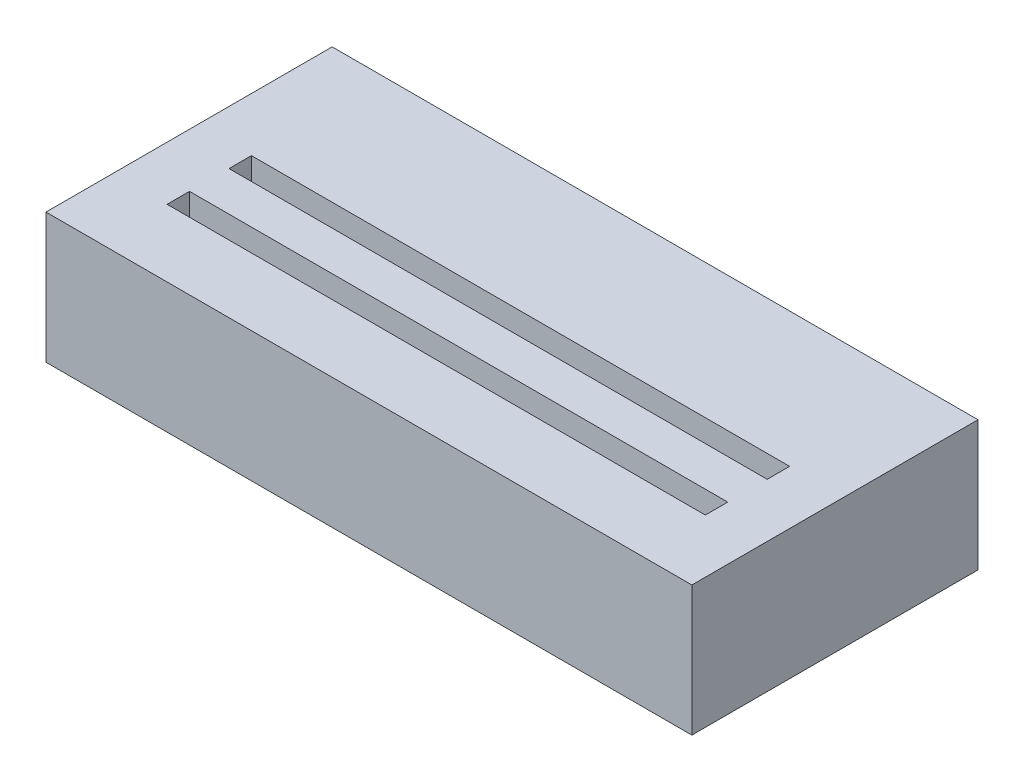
ISO-10303-21;
HEADER;
FILE_DESCRIPTION(('STEP AP214'),'2;1');
FILE_NAME('part.step','',(''),(''),'','','');
FILE_SCHEMA(('AUTOMOTIVE_DESIGN { 1 0 10303 214 1 1 1 1 }'));
ENDSEC;
DATA;
#1=APPLICATION_CONTEXT('core data for automotive mechanical design processes');
#2=APPLICATION_PROTOCOL_DEFINITION('international standard','automotive_design',2000,#1);
#3=PRODUCT_CONTEXT('',#1,'mechanical');
#4=PRODUCT('Part','Part','',(#3));
#5=PRODUCT_RELATED_PRODUCT_CATEGORY('part','',(#4));
#6=PRODUCT_DEFINITION_FORMATION('','',#4);
#7=PRODUCT_DEFINITION_CONTEXT('part definition',#1,'design');
#8=PRODUCT_DEFINITION('design','',#6,#7);
#9=PRODUCT_DEFINITION_SHAPE('','',#8);
#10=(LENGTH_UNIT() NAMED_UNIT(*) SI_UNIT(.MILLI.,.METRE.));
#11=(NAMED_UNIT(*) PLANE_ANGLE_UNIT() SI_UNIT($,.RADIAN.));
#12=(NAMED_UNIT(*) SI_UNIT($,.STERADIAN.) SOLID_ANGLE_UNIT());
#13=UNCERTAINTY_MEASURE_WITH_UNIT(LENGTH_MEASURE(1.E-05),#10,'distance_accuracy_value','');
#14=(GEOMETRIC_REPRESENTATION_CONTEXT(3) GLOBAL_UNCERTAINTY_ASSIGNED_CONTEXT((#13)) GLOBAL_UNIT_ASSIGNED_CONTEXT((#10,
#11,#12)) REPRESENTATION_CONTEXT('',''));
#15=CARTESIAN_POINT('',(0.,0.,0.));
#16=DIRECTION('',(0.,0.,1.));
#17=DIRECTION('',(1.,0.,0.));
#18=AXIS2_PLACEMENT_3D('',#15,#16,#17);
#19=CARTESIAN_POINT('',(-4.318,-2.413,7.62));
#20=DIRECTION('',(0.,1.,0.));
#21=DIRECTION('',(0.,0.,1.));
#22=AXIS2_PLACEMENT_3D('',#19,#20,#21);
#23=PLANE('',#22);
#24=DIRECTION('',(0.,0.,-1.));
#25=VECTOR('',#24,1.);
#26=CARTESIAN_POINT('',(-1.27,-2.413,12.3952));
#27=LINE('',#26,#25);
#28=CARTESIAN_POINT('',(-1.27,-2.413,12.3952));
#29=VERTEX_POINT('',#28);
#30=CARTESIAN_POINT('',(-1.27,-2.413,11.1252));
#31=VERTEX_POINT('',#30);
#32=EDGE_CURVE('E301',#29,#31,#27,.T.);
#33=ORIENTED_EDGE('',*,*,#32,.F.);
#34=DIRECTION('',(1.,0.,0.));
#35=VECTOR('',#34,1.);
#36=CARTESIAN_POINT('',(-4.318,-2.413,12.3952));
#37=LINE('',#36,#35);
#38=CARTESIAN_POINT('',(29.21,-2.413,12.3952));
#39=VERTEX_POINT('',#38);
#40=EDGE_CURVE('E169',#29,#39,#37,.T.);
#41=ORIENTED_EDGE('',*,*,#40,.T.);
#42=DIRECTION('',(0.,0.,-1.));
#43=VECTOR('',#42,1.);
#44=CARTESIAN_POINT('',(29.21,-2.413,12.3952));
#45=LINE('',#44,#43);
#46=CARTESIAN_POINT('',(29.21,-2.413,11.1252));
#47=VERTEX_POINT('',#46);
#48=EDGE_CURVE('E277',#39,#47,#45,.T.);
#49=ORIENTED_EDGE('',*,*,#48,.T.);
#50=DIRECTION('',(1.,0.,0.));
#51=VECTOR('',#50,1.);
#52=CARTESIAN_POINT('',(-4.318,-2.413,11.1252));
#53=LINE('',#52,#51);
#54=EDGE_CURVE('E299',#31,#47,#53,.T.);
#55=ORIENTED_EDGE('',*,*,#54,.F.);
#56=EDGE_LOOP('',(#33,#41,#49,#55));
#57=FACE_BOUND('',#56,.T.);
#58=DIRECTION('',(0.,0.,-1.));
#59=VECTOR('',#58,1.);
#60=CARTESIAN_POINT('',(11.557,-2.413,0.));
#61=LINE('',#60,#59);
#62=CARTESIAN_POINT('',(11.557,-2.413,7.62));
#63=VERTEX_POINT('',#62);
#64=CARTESIAN_POINT('',(11.557,-2.413,0.));
#65=VERTEX_POINT('',#64);
#66=EDGE_CURVE('E168',#63,#65,#61,.T.);
#67=ORIENTED_EDGE('',*,*,#66,.F.);
#68=DIRECTION('',(1.,0.,0.));
#69=VECTOR('',#68,1.);
#70=CARTESIAN_POINT('',(-4.318,-2.413,7.62));
#71=LINE('',#70,#69);
#72=CARTESIAN_POINT('',(-1.27,-2.413,7.62));
#73=VERTEX_POINT('',#72);
#74=EDGE_CURVE('E207',#73,#63,#71,.T.);
#75=ORIENTED_EDGE('',*,*,#74,.F.);
#76=DIRECTION('',(0.,0.,-1.));
#77=VECTOR('',#76,1.);
#78=CARTESIAN_POINT('',(-1.27,-2.413,8.89));
#79=LINE('',#78,#77);
#80=CARTESIAN_POINT('',(-1.27,-2.413,8.89));
#81=VERTEX_POINT('',#80);
#82=EDGE_CURVE('E338',#81,#73,#79,.T.);
#83=ORIENTED_EDGE('',*,*,#82,.F.);
#84=DIRECTION('',(1.,0.,0.));
#85=VECTOR('',#84,1.);
#86=CARTESIAN_POINT('',(-4.318,-2.413,8.89));
#87=LINE('',#86,#85);
#88=CARTESIAN_POINT('',(29.21,-2.413,8.89));
#89=VERTEX_POINT('',#88);
#90=EDGE_CURVE('E305',#81,#89,#87,.T.);
#91=ORIENTED_EDGE('',*,*,#90,.T.);
#92=DIRECTION('',(0.,0.,-1.));
#93=VECTOR('',#92,1.);
#94=CARTESIAN_POINT('',(29.21,-2.413,8.89));
#95=LINE('',#94,#93);
#96=CARTESIAN_POINT('',(29.21,-2.413,7.62));
#97=VERTEX_POINT('',#96);
#98=EDGE_CURVE('E321',#89,#97,#95,.T.);
#99=ORIENTED_EDGE('',*,*,#98,.T.);
#100=CARTESIAN_POINT('',(16.383,-2.413,7.62));
#101=VERTEX_POINT('',#100);
#102=EDGE_CURVE('E212',#101,#97,#71,.T.);
#103=ORIENTED_EDGE('',*,*,#102,.F.);
#104=DIRECTION('',(0.,0.,1.));
#105=VECTOR('',#104,1.);
#106=CARTESIAN_POINT('',(16.383,-2.413,0.));
#107=LINE('',#106,#105);
#108=CARTESIAN_POINT('',(16.383,-2.413,0.));
#109=VERTEX_POINT('',#108);
#110=EDGE_CURVE('E50',#109,#101,#107,.T.);
#111=ORIENTED_EDGE('',*,*,#110,.F.);
#112=DIRECTION('',(1.,0.,0.));
#113=VECTOR('',#112,1.);
#114=CARTESIAN_POINT('',(-4.318,-2.413,0.));
#115=LINE('',#114,#113);
#116=CARTESIAN_POINT('',(32.258,-2.413,0.));
#117=VERTEX_POINT('',#116);
#118=EDGE_CURVE('E194',#109,#117,#115,.T.);
#119=ORIENTED_EDGE('',*,*,#118,.T.);
#120=DIRECTION('',(0.,0.,-1.));
#121=VECTOR('',#120,1.);
#122=CARTESIAN_POINT('',(32.258,-2.413,7.62));
#123=LINE('',#122,#121);
#124=CARTESIAN_POINT('',(32.258,-2.413,16.2052));
#125=VERTEX_POINT('',#124);
#126=EDGE_CURVE('E42',#125,#117,#123,.T.);
#127=ORIENTED_EDGE('',*,*,#126,.F.);
#128=DIRECTION('',(1.,0.,0.));
#129=VECTOR('',#128,1.);
#130=CARTESIAN_POINT('',(-4.318,-2.413,16.2052));
#131=LINE('',#130,#129);
#132=CARTESIAN_POINT('',(-4.318,-2.413,16.2052));
#133=VERTEX_POINT('',#132);
#134=EDGE_CURVE('E266',#133,#125,#131,.T.);
#135=ORIENTED_EDGE('',*,*,#134,.F.);
#136=DIRECTION('',(0.,0.,-1.));
#137=VECTOR('',#136,1.);
#138=CARTESIAN_POINT('',(-4.318,-2.413,7.62));
#139=LINE('',#138,#137);
#140=CARTESIAN_POINT('',(-4.318,-2.413,0.));
#141=VERTEX_POINT('',#140);
#142=EDGE_CURVE('E11',#133,#141,#139,.T.);
#143=ORIENTED_EDGE('',*,*,#142,.T.);
#144=EDGE_CURVE('E56',#141,#65,#115,.T.);
#145=ORIENTED_EDGE('',*,*,#144,.T.);
#146=EDGE_LOOP('',(#67,#75,#83,#91,#99,#103,#111,#119,#127,#135,#143,#145));
#147=FACE_BOUND('',#146,.T.);
#148=ADVANCED_FACE('F33',(#57,#147),#23,.F.);
#149=CARTESIAN_POINT('',(-4.318,-2.413,11.1252));
#150=DIRECTION('',(0.,0.,1.));
#151=DIRECTION('',(1.,0.,0.));
#152=AXIS2_PLACEMENT_3D('',#149,#150,#151);
#153=PLANE('',#152);
#154=ORIENTED_EDGE('',*,*,#54,.T.);
#155=DIRECTION('',(0.,-1.,0.));
#156=VECTOR('',#155,1.);
#157=CARTESIAN_POINT('',(29.21,4.953,11.1252));
#158=LINE('',#157,#156);
#159=CARTESIAN_POINT('',(29.21,4.953,11.1252));
#160=VERTEX_POINT('',#159);
#161=EDGE_CURVE('E278',#160,#47,#158,.T.);
#162=ORIENTED_EDGE('',*,*,#161,.F.);
#163=DIRECTION('',(-1.,0.,0.));
#164=VECTOR('',#163,1.);
#165=CARTESIAN_POINT('',(-4.318,4.953,11.1252));
#166=LINE('',#165,#164);
#167=CARTESIAN_POINT('',(-1.27,4.953,11.1252));
#168=VERTEX_POINT('',#167);
#169=EDGE_CURVE('E232',#160,#168,#166,.T.);
#170=ORIENTED_EDGE('',*,*,#169,.T.);
#171=DIRECTION('',(0.,1.,0.));
#172=VECTOR('',#171,1.);
#173=CARTESIAN_POINT('',(-1.27,4.953,11.1252));
#174=LINE('',#173,#172);
#175=EDGE_CURVE('E287',#31,#168,#174,.T.);
#176=ORIENTED_EDGE('',*,*,#175,.F.);
#177=EDGE_LOOP('',(#154,#162,#170,#176));
#178=FACE_BOUND('',#177,.T.);
#179=ADVANCED_FACE('F480',(#178),#153,.T.);
#180=CARTESIAN_POINT('',(-4.318,-2.413,7.62));
#181=DIRECTION('',(0.,0.,1.));
#182=DIRECTION('',(1.,0.,0.));
#183=AXIS2_PLACEMENT_3D('',#180,#181,#182);
#184=PLANE('',#183);
#185=CARTESIAN_POINT('',(0.,0.,7.62));
#186=DIRECTION('',(0.,0.,1.));
#187=DIRECTION('',(1.,0.,0.));
#188=AXIS2_PLACEMENT_3D('',#185,#186,#187);
#189=CIRCLE('',#188,0.508);
#190=CARTESIAN_POINT('',(0.508,0.,7.62));
#191=VERTEX_POINT('',#190);
#192=EDGE_CURVE('E226',#191,#191,#189,.F.);
#193=ORIENTED_EDGE('',*,*,#192,.T.);
#194=EDGE_LOOP('',(#193));
#195=FACE_BOUND('',#194,.T.);
#196=CARTESIAN_POINT('',(2.54,0.,7.62));
#197=DIRECTION('',(0.,0.,1.));
#198=DIRECTION('',(1.,0.,0.));
#199=AXIS2_PLACEMENT_3D('',#196,#197,#198);
#200=CIRCLE('',#199,0.508);
#201=CARTESIAN_POINT('',(3.048,0.,7.62));
#202=VERTEX_POINT('',#201);
#203=EDGE_CURVE('E470',#202,#202,#200,.F.);
#204=ORIENTED_EDGE('',*,*,#203,.T.);
#205=EDGE_LOOP('',(#204));
#206=FACE_BOUND('',#205,.T.);
#207=CARTESIAN_POINT('',(5.08,0.,7.62));
#208=DIRECTION('',(0.,0.,1.));
#209=DIRECTION('',(1.,0.,0.));
#210=AXIS2_PLACEMENT_3D('',#207,#208,#209);
#211=CIRCLE('',#210,0.508);
#212=CARTESIAN_POINT('',(5.588,0.,7.62));
#213=VERTEX_POINT('',#212);
#214=EDGE_CURVE('E464',#213,#213,#211,.F.);
#215=ORIENTED_EDGE('',*,*,#214,.T.);
#216=EDGE_LOOP('',(#215));
#217=FACE_BOUND('',#216,.T.);
#218=CARTESIAN_POINT('',(7.62,0.,7.62));
#219=DIRECTION('',(0.,0.,1.));
#220=DIRECTION('',(1.,0.,0.));
#221=AXIS2_PLACEMENT_3D('',#218,#219,#220);
#222=CIRCLE('',#221,0.508);
#223=CARTESIAN_POINT('',(8.128,0.,7.62));
#224=VERTEX_POINT('',#223);
#225=EDGE_CURVE('E458',#224,#224,#222,.F.);
#226=ORIENTED_EDGE('',*,*,#225,.T.);
#227=EDGE_LOOP('',(#226));
#228=FACE_BOUND('',#227,.T.);
#229=CARTESIAN_POINT('',(10.16,0.,7.62));
#230=DIRECTION('',(0.,0.,1.));
#231=DIRECTION('',(1.,0.,0.));
#232=AXIS2_PLACEMENT_3D('',#229,#230,#231);
#233=CIRCLE('',#232,0.508);
#234=CARTESIAN_POINT('',(10.668,0.,7.62));
#235=VERTEX_POINT('',#234);
#236=EDGE_CURVE('E452',#235,#235,#233,.F.);
#237=ORIENTED_EDGE('',*,*,#236,.T.);
#238=EDGE_LOOP('',(#237));
#239=FACE_BOUND('',#238,.T.);
#240=CARTESIAN_POINT('',(12.7,0.,7.62));
#241=DIRECTION('',(0.,0.,1.));
#242=DIRECTION('',(1.,0.,0.));
#243=AXIS2_PLACEMENT_3D('',#240,#241,#242);
#244=CIRCLE('',#243,0.508);
#245=CARTESIAN_POINT('',(13.208,0.,7.62));
#246=VERTEX_POINT('',#245);
#247=EDGE_CURVE('E446',#246,#246,#244,.F.);
#248=ORIENTED_EDGE('',*,*,#247,.T.);
#249=EDGE_LOOP('',(#248));
#250=FACE_BOUND('',#249,.T.);
#251=CARTESIAN_POINT('',(15.24,0.,7.62));
#252=DIRECTION('',(0.,0.,1.));
#253=DIRECTION('',(1.,0.,0.));
#254=AXIS2_PLACEMENT_3D('',#251,#252,#253);
#255=CIRCLE('',#254,0.508);
#256=CARTESIAN_POINT('',(15.748,0.,7.62));
#257=VERTEX_POINT('',#256);
#258=EDGE_CURVE('E440',#257,#257,#255,.F.);
#259=ORIENTED_EDGE('',*,*,#258,.T.);
#260=EDGE_LOOP('',(#259));
#261=FACE_BOUND('',#260,.T.);
#262=CARTESIAN_POINT('',(17.78,0.,7.62));
#263=DIRECTION('',(0.,0.,1.));
#264=DIRECTION('',(1.,0.,0.));
#265=AXIS2_PLACEMENT_3D('',#262,#263,#264);
#266=CIRCLE('',#265,0.508000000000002);
#267=CARTESIAN_POINT('',(18.288,0.,7.62));
#268=VERTEX_POINT('',#267);
#269=EDGE_CURVE('E434',#268,#268,#266,.F.);
#270=ORIENTED_EDGE('',*,*,#269,.T.);
#271=EDGE_LOOP('',(#270));
#272=FACE_BOUND('',#271,.T.);
#273=CARTESIAN_POINT('',(20.32,0.,7.62));
#274=DIRECTION('',(0.,0.,1.));
#275=DIRECTION('',(1.,0.,0.));
#276=AXIS2_PLACEMENT_3D('',#273,#274,#275);
#277=CIRCLE('',#276,0.508000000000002);
#278=CARTESIAN_POINT('',(20.828,0.,7.62));
#279=VERTEX_POINT('',#278);
#280=EDGE_CURVE('E428',#279,#279,#277,.F.);
#281=ORIENTED_EDGE('',*,*,#280,.T.);
#282=EDGE_LOOP('',(#281));
#283=FACE_BOUND('',#282,.T.);
#284=CARTESIAN_POINT('',(22.86,0.,7.62));
#285=DIRECTION('',(0.,0.,1.));
#286=DIRECTION('',(1.,0.,0.));
#287=AXIS2_PLACEMENT_3D('',#284,#285,#286);
#288=CIRCLE('',#287,0.508000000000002);
#289=CARTESIAN_POINT('',(23.368,0.,7.62));
#290=VERTEX_POINT('',#289);
#291=EDGE_CURVE('E422',#290,#290,#288,.F.);
#292=ORIENTED_EDGE('',*,*,#291,.T.);
#293=EDGE_LOOP('',(#292));
#294=FACE_BOUND('',#293,.T.);
#295=CARTESIAN_POINT('',(25.4,0.,7.62));
#296=DIRECTION('',(0.,0.,1.));
#297=DIRECTION('',(1.,0.,0.));
#298=AXIS2_PLACEMENT_3D('',#295,#296,#297);
#299=CIRCLE('',#298,0.508000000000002);
#300=CARTESIAN_POINT('',(25.908,0.,7.62));
#301=VERTEX_POINT('',#300);
#302=EDGE_CURVE('E416',#301,#301,#299,.F.);
#303=ORIENTED_EDGE('',*,*,#302,.T.);
#304=EDGE_LOOP('',(#303));
#305=FACE_BOUND('',#304,.T.);
#306=CARTESIAN_POINT('',(27.94,0.,7.62));
#307=DIRECTION('',(0.,0.,1.));
#308=DIRECTION('',(1.,0.,0.));
#309=AXIS2_PLACEMENT_3D('',#306,#307,#308);
#310=CIRCLE('',#309,0.508000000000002);
#311=CARTESIAN_POINT('',(28.448,0.,7.62));
#312=VERTEX_POINT('',#311);
#313=EDGE_CURVE('E410',#312,#312,#310,.F.);
#314=ORIENTED_EDGE('',*,*,#313,.T.);
#315=EDGE_LOOP('',(#314));
#316=FACE_BOUND('',#315,.T.);
#317=CARTESIAN_POINT('',(0.,2.54,7.62));
#318=DIRECTION('',(0.,0.,1.));
#319=DIRECTION('',(1.,0.,0.));
#320=AXIS2_PLACEMENT_3D('',#317,#318,#319);
#321=CIRCLE('',#320,0.508);
#322=CARTESIAN_POINT('',(0.508,2.54,7.62));
#323=VERTEX_POINT('',#322);
#324=EDGE_CURVE('E404',#323,#323,#321,.F.);
#325=ORIENTED_EDGE('',*,*,#324,.T.);
#326=EDGE_LOOP('',(#325));
#327=FACE_BOUND('',#326,.T.);
#328=CARTESIAN_POINT('',(2.54,2.54,7.62));
#329=DIRECTION('',(0.,0.,1.));
#330=DIRECTION('',(1.,0.,0.));
#331=AXIS2_PLACEMENT_3D('',#328,#329,#330);
#332=CIRCLE('',#331,0.508);
#333=CARTESIAN_POINT('',(3.048,2.54,7.62));
#334=VERTEX_POINT('',#333);
#335=EDGE_CURVE('E398',#334,#334,#332,.F.);
#336=ORIENTED_EDGE('',*,*,#335,.T.);
#337=EDGE_LOOP('',(#336));
#338=FACE_BOUND('',#337,.T.);
#339=CARTESIAN_POINT('',(5.08,2.54,7.62));
#340=DIRECTION('',(0.,0.,1.));
#341=DIRECTION('',(1.,0.,0.));
#342=AXIS2_PLACEMENT_3D('',#339,#340,#341);
#343=CIRCLE('',#342,0.508);
#344=CARTESIAN_POINT('',(5.588,2.54,7.62));
#345=VERTEX_POINT('',#344);
#346=EDGE_CURVE('E392',#345,#345,#343,.F.);
#347=ORIENTED_EDGE('',*,*,#346,.T.);
#348=EDGE_LOOP('',(#347));
#349=FACE_BOUND('',#348,.T.);
#350=CARTESIAN_POINT('',(7.62,2.54,7.62));
#351=DIRECTION('',(0.,0.,1.));
#352=DIRECTION('',(1.,0.,0.));
#353=AXIS2_PLACEMENT_3D('',#350,#351,#352);
#354=CIRCLE('',#353,0.508);
#355=CARTESIAN_POINT('',(8.128,2.54,7.62));
#356=VERTEX_POINT('',#355);
#357=EDGE_CURVE('E386',#356,#356,#354,.F.);
#358=ORIENTED_EDGE('',*,*,#357,.T.);
#359=EDGE_LOOP('',(#358));
#360=FACE_BOUND('',#359,.T.);
#361=CARTESIAN_POINT('',(10.16,2.54,7.62));
#362=DIRECTION('',(0.,0.,1.));
#363=DIRECTION('',(1.,0.,0.));
#364=AXIS2_PLACEMENT_3D('',#361,#362,#363);
#365=CIRCLE('',#364,0.508);
#366=CARTESIAN_POINT('',(10.668,2.54,7.62));
#367=VERTEX_POINT('',#366);
#368=EDGE_CURVE('E380',#367,#367,#365,.F.);
#369=ORIENTED_EDGE('',*,*,#368,.T.);
#370=EDGE_LOOP('',(#369));
#371=FACE_BOUND('',#370,.T.);
#372=CARTESIAN_POINT('',(12.7,2.54,7.62));
#373=DIRECTION('',(0.,0.,1.));
#374=DIRECTION('',(1.,0.,0.));
#375=AXIS2_PLACEMENT_3D('',#372,#373,#374);
#376=CIRCLE('',#375,0.508);
#377=CARTESIAN_POINT('',(13.208,2.54,7.62));
#378=VERTEX_POINT('',#377);
#379=EDGE_CURVE('E374',#378,#378,#376,.F.);
#380=ORIENTED_EDGE('',*,*,#379,.T.);
#381=EDGE_LOOP('',(#380));
#382=FACE_BOUND('',#381,.T.);
#383=CARTESIAN_POINT('',(15.24,2.54,7.62));
#384=DIRECTION('',(0.,0.,1.));
#385=DIRECTION('',(1.,0.,0.));
#386=AXIS2_PLACEMENT_3D('',#383,#384,#385);
#387=CIRCLE('',#386,0.508);
#388=CARTESIAN_POINT('',(15.748,2.54,7.62));
#389=VERTEX_POINT('',#388);
#390=EDGE_CURVE('E368',#389,#389,#387,.F.);
#391=ORIENTED_EDGE('',*,*,#390,.T.);
#392=EDGE_LOOP('',(#391));
#393=FACE_BOUND('',#392,.T.);
#394=CARTESIAN_POINT('',(17.78,2.54,7.62));
#395=DIRECTION('',(0.,0.,1.));
#396=DIRECTION('',(1.,0.,0.));
#397=AXIS2_PLACEMENT_3D('',#394,#395,#396);
#398=CIRCLE('',#397,0.508000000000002);
#399=CARTESIAN_POINT('',(18.288,2.54,7.62));
#400=VERTEX_POINT('',#399);
#401=EDGE_CURVE('E362',#400,#400,#398,.F.);
#402=ORIENTED_EDGE('',*,*,#401,.T.);
#403=EDGE_LOOP('',(#402));
#404=FACE_BOUND('',#403,.T.);
#405=CARTESIAN_POINT('',(20.32,2.54,7.62));
#406=DIRECTION('',(0.,0.,1.));
#407=DIRECTION('',(1.,0.,0.));
#408=AXIS2_PLACEMENT_3D('',#405,#406,#407);
#409=CIRCLE('',#408,0.508000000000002);
#410=CARTESIAN_POINT('',(20.828,2.54,7.62));
#411=VERTEX_POINT('',#410);
#412=EDGE_CURVE('E356',#411,#411,#409,.F.);
#413=ORIENTED_EDGE('',*,*,#412,.T.);
#414=EDGE_LOOP('',(#413));
#415=FACE_BOUND('',#414,.T.);
#416=CARTESIAN_POINT('',(22.86,2.54,7.62));
#417=DIRECTION('',(0.,0.,1.));
#418=DIRECTION('',(1.,0.,0.));
#419=AXIS2_PLACEMENT_3D('',#416,#417,#418);
#420=CIRCLE('',#419,0.508000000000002);
#421=CARTESIAN_POINT('',(23.368,2.54,7.62));
#422=VERTEX_POINT('',#421);
#423=EDGE_CURVE('E350',#422,#422,#420,.F.);
#424=ORIENTED_EDGE('',*,*,#423,.T.);
#425=EDGE_LOOP('',(#424));
#426=FACE_BOUND('',#425,.T.);
#427=CARTESIAN_POINT('',(25.4,2.54,7.62));
#428=DIRECTION('',(0.,0.,1.));
#429=DIRECTION('',(1.,0.,0.));
#430=AXIS2_PLACEMENT_3D('',#427,#428,#429);
#431=CIRCLE('',#430,0.508000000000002);
#432=CARTESIAN_POINT('',(25.908,2.54,7.62));
#433=VERTEX_POINT('',#432);
#434=EDGE_CURVE('E344',#433,#433,#431,.F.);
#435=ORIENTED_EDGE('',*,*,#434,.T.);
#436=EDGE_LOOP('',(#435));
#437=FACE_BOUND('',#436,.T.);
#438=CARTESIAN_POINT('',(27.94,2.54,7.62));
#439=DIRECTION('',(0.,0.,1.));
#440=DIRECTION('',(1.,0.,0.));
#441=AXIS2_PLACEMENT_3D('',#438,#439,#440);
#442=CIRCLE('',#441,0.508000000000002);
#443=CARTESIAN_POINT('',(28.448,2.54,7.62));
#444=VERTEX_POINT('',#443);
#445=EDGE_CURVE('E337',#444,#444,#442,.F.);
#446=ORIENTED_EDGE('',*,*,#445,.T.);
#447=EDGE_LOOP('',(#446));
#448=FACE_BOUND('',#447,.T.);
#449=ORIENTED_EDGE('',*,*,#74,.T.);
#450=DIRECTION('',(0.,1.,0.));
#451=VECTOR('',#450,1.);
#452=CARTESIAN_POINT('',(11.557,-3.048,7.62));
#453=LINE('',#452,#451);
#454=CARTESIAN_POINT('',(11.557,-3.048,7.62));
#455=VERTEX_POINT('',#454);
#456=EDGE_CURVE('E182',#455,#63,#453,.T.);
#457=ORIENTED_EDGE('',*,*,#456,.F.);
#458=DIRECTION('',(-1.,0.,0.));
#459=VECTOR('',#458,1.);
#460=CARTESIAN_POINT('',(11.557,-3.048,7.62));
#461=LINE('',#460,#459);
#462=CARTESIAN_POINT('',(16.383,-3.048,7.62));
#463=VERTEX_POINT('',#462);
#464=EDGE_CURVE('E162',#463,#455,#461,.T.);
#465=ORIENTED_EDGE('',*,*,#464,.F.);
#466=DIRECTION('',(0.,1.,0.));
#467=VECTOR('',#466,1.);
#468=CARTESIAN_POINT('',(16.383,-3.048,7.62));
#469=LINE('',#468,#467);
#470=EDGE_CURVE('E174',#463,#101,#469,.T.);
#471=ORIENTED_EDGE('',*,*,#470,.T.);
#472=ORIENTED_EDGE('',*,*,#102,.T.);
#473=DIRECTION('',(0.,-1.,0.));
#474=VECTOR('',#473,1.);
#475=CARTESIAN_POINT('',(29.21,4.953,7.62));
#476=LINE('',#475,#474);
#477=CARTESIAN_POINT('',(29.21,4.953,7.62));
#478=VERTEX_POINT('',#477);
#479=EDGE_CURVE('E322',#478,#97,#476,.T.);
#480=ORIENTED_EDGE('',*,*,#479,.F.);
#481=DIRECTION('',(-1.,0.,0.));
#482=VECTOR('',#481,1.);
#483=CARTESIAN_POINT('',(-4.318,4.953,7.62));
#484=LINE('',#483,#482);
#485=CARTESIAN_POINT('',(-1.27,4.953,7.62));
#486=VERTEX_POINT('',#485);
#487=EDGE_CURVE('E211',#478,#486,#484,.T.);
#488=ORIENTED_EDGE('',*,*,#487,.T.);
#489=DIRECTION('',(0.,1.,0.));
#490=VECTOR('',#489,1.);
#491=CARTESIAN_POINT('',(-1.27,4.953,7.62));
#492=LINE('',#491,#490);
#493=EDGE_CURVE('E209',#73,#486,#492,.T.);
#494=ORIENTED_EDGE('',*,*,#493,.F.);
#495=EDGE_LOOP('',(#449,#457,#465,#471,#472,#480,#488,#494));
#496=FACE_BOUND('',#495,.T.);
#497=ADVANCED_FACE('F205',(#195,#206,#217,#228,#239,#250,#261,#272,#283,#294,#305,#316,#327,
#338,#349,#360,#371,#382,#393,#404,#415,#426,#437,#448,#496),#184,.T.);
#498=CARTESIAN_POINT('',(-4.318,4.953,7.62));
#499=DIRECTION('',(1.,0.,0.));
#500=DIRECTION('',(0.,1.,0.));
#501=AXIS2_PLACEMENT_3D('',#498,#499,#500);
#502=PLANE('',#501);
#503=DIRECTION('',(0.,-1.,0.));
#504=VECTOR('',#503,1.);
#505=CARTESIAN_POINT('',(-4.318,4.953,0.));
#506=LINE('',#505,#504);
#507=CARTESIAN_POINT('',(-4.318,4.953,0.));
#508=VERTEX_POINT('',#507);
#509=EDGE_CURVE('E238',#508,#141,#506,.T.);
#510=ORIENTED_EDGE('',*,*,#509,.T.);
#511=ORIENTED_EDGE('',*,*,#142,.F.);
#512=DIRECTION('',(0.,-1.,0.));
#513=VECTOR('',#512,1.);
#514=CARTESIAN_POINT('',(-4.318,4.953,16.2052));
#515=LINE('',#514,#513);
#516=CARTESIAN_POINT('',(-4.318,4.953,16.2052));
#517=VERTEX_POINT('',#516);
#518=EDGE_CURVE('E189',#517,#133,#515,.T.);
#519=ORIENTED_EDGE('',*,*,#518,.F.);
#520=DIRECTION('',(0.,0.,-1.));
#521=VECTOR('',#520,1.);
#522=CARTESIAN_POINT('',(-4.318,4.953,7.62));
#523=LINE('',#522,#521);
#524=EDGE_CURVE('E214',#517,#508,#523,.T.);
#525=ORIENTED_EDGE('',*,*,#524,.T.);
#526=EDGE_LOOP('',(#510,#511,#519,#525));
#527=FACE_BOUND('',#526,.T.);
#528=ADVANCED_FACE('F35',(#527),#502,.F.);
#529=CARTESIAN_POINT('',(32.258,4.953,7.62));
#530=DIRECTION('',(-1.,0.,0.));
#531=DIRECTION('',(0.,0.,1.));
#532=AXIS2_PLACEMENT_3D('',#529,#530,#531);
#533=PLANE('',#532);
#534=DIRECTION('',(0.,1.,0.));
#535=VECTOR('',#534,1.);
#536=CARTESIAN_POINT('',(32.258,4.953,0.));
#537=LINE('',#536,#535);
#538=CARTESIAN_POINT('',(32.258,4.953,0.));
#539=VERTEX_POINT('',#538);
#540=EDGE_CURVE('E235',#117,#539,#537,.T.);
#541=ORIENTED_EDGE('',*,*,#540,.T.);
#542=DIRECTION('',(0.,0.,-1.));
#543=VECTOR('',#542,1.);
#544=CARTESIAN_POINT('',(32.258,4.953,7.62));
#545=LINE('',#544,#543);
#546=CARTESIAN_POINT('',(32.258,4.953,16.2052));
#547=VERTEX_POINT('',#546);
#548=EDGE_CURVE('E244',#547,#539,#545,.T.);
#549=ORIENTED_EDGE('',*,*,#548,.F.);
#550=DIRECTION('',(0.,1.,0.));
#551=VECTOR('',#550,1.);
#552=CARTESIAN_POINT('',(32.258,4.953,16.2052));
#553=LINE('',#552,#551);
#554=EDGE_CURVE('E252',#125,#547,#553,.T.);
#555=ORIENTED_EDGE('',*,*,#554,.F.);
#556=ORIENTED_EDGE('',*,*,#126,.T.);
#557=EDGE_LOOP('',(#541,#549,#555,#556));
#558=FACE_BOUND('',#557,.T.);
#559=ADVANCED_FACE('F250',(#558),#533,.F.);
#560=CARTESIAN_POINT('',(-4.318,4.953,7.62));
#561=DIRECTION('',(0.,-1.,0.));
#562=DIRECTION('',(0.,0.,-1.));
#563=AXIS2_PLACEMENT_3D('',#560,#561,#562);
#564=PLANE('',#563);
#565=ORIENTED_EDGE('',*,*,#524,.F.);
#566=DIRECTION('',(-1.,0.,0.));
#567=VECTOR('',#566,1.);
#568=CARTESIAN_POINT('',(-4.318,4.953,16.2052));
#569=LINE('',#568,#567);
#570=EDGE_CURVE('E281',#547,#517,#569,.T.);
#571=ORIENTED_EDGE('',*,*,#570,.F.);
#572=ORIENTED_EDGE('',*,*,#548,.T.);
#573=DIRECTION('',(-1.,0.,0.));
#574=VECTOR('',#573,1.);
#575=CARTESIAN_POINT('',(-4.318,4.953,0.));
#576=LINE('',#575,#574);
#577=EDGE_CURVE('E216',#539,#508,#576,.T.);
#578=ORIENTED_EDGE('',*,*,#577,.T.);
#579=EDGE_LOOP('',(#565,#571,#572,#578));
#580=FACE_BOUND('',#579,.T.);
#581=DIRECTION('',(-1.,0.,0.));
#582=VECTOR('',#581,1.);
#583=CARTESIAN_POINT('',(-4.318,4.953,12.3952));
#584=LINE('',#583,#582);
#585=CARTESIAN_POINT('',(29.21,4.953,12.3952));
#586=VERTEX_POINT('',#585);
#587=CARTESIAN_POINT('',(-1.27,4.953,12.3952));
#588=VERTEX_POINT('',#587);
#589=EDGE_CURVE('E172',#586,#588,#584,.T.);
#590=ORIENTED_EDGE('',*,*,#589,.T.);
#591=DIRECTION('',(0.,0.,-1.));
#592=VECTOR('',#591,1.);
#593=CARTESIAN_POINT('',(-1.27,4.953,12.3952));
#594=LINE('',#593,#592);
#595=EDGE_CURVE('E291',#588,#168,#594,.T.);
#596=ORIENTED_EDGE('',*,*,#595,.T.);
#597=ORIENTED_EDGE('',*,*,#169,.F.);
#598=DIRECTION('',(0.,0.,-1.));
#599=VECTOR('',#598,1.);
#600=CARTESIAN_POINT('',(29.21,4.953,12.3952));
#601=LINE('',#600,#599);
#602=EDGE_CURVE('E284',#586,#160,#601,.T.);
#603=ORIENTED_EDGE('',*,*,#602,.F.);
#604=EDGE_LOOP('',(#590,#596,#597,#603));
#605=FACE_BOUND('',#604,.T.);
#606=DIRECTION('',(-1.,0.,0.));
#607=VECTOR('',#606,1.);
#608=CARTESIAN_POINT('',(-4.318,4.953,8.89));
#609=LINE('',#608,#607);
#610=CARTESIAN_POINT('',(29.21,4.953,8.89));
#611=VERTEX_POINT('',#610);
#612=CARTESIAN_POINT('',(-1.27,4.953,8.89));
#613=VERTEX_POINT('',#612);
#614=EDGE_CURVE('E310',#611,#613,#609,.T.);
#615=ORIENTED_EDGE('',*,*,#614,.T.);
#616=DIRECTION('',(0.,0.,-1.));
#617=VECTOR('',#616,1.);
#618=CARTESIAN_POINT('',(-1.27,4.953,8.89));
#619=LINE('',#618,#617);
#620=EDGE_CURVE('E331',#613,#486,#619,.T.);
#621=ORIENTED_EDGE('',*,*,#620,.T.);
#622=ORIENTED_EDGE('',*,*,#487,.F.);
#623=DIRECTION('',(0.,0.,-1.));
#624=VECTOR('',#623,1.);
#625=CARTESIAN_POINT('',(29.21,4.953,8.89));
#626=LINE('',#625,#624);
#627=EDGE_CURVE('E326',#611,#478,#626,.T.);
#628=ORIENTED_EDGE('',*,*,#627,.F.);
#629=EDGE_LOOP('',(#615,#621,#622,#628));
#630=FACE_BOUND('',#629,.T.);
#631=ADVANCED_FACE('F258',(#580,#605,#630),#564,.F.);
#632=CARTESIAN_POINT('',(-4.318,-2.413,0.));
#633=DIRECTION('',(0.,0.,1.));
#634=DIRECTION('',(1.,0.,0.));
#635=AXIS2_PLACEMENT_3D('',#632,#633,#634);
#636=PLANE('',#635);
#637=CARTESIAN_POINT('',(27.94,2.54,0.));
#638=DIRECTION('',(0.,0.,-1.));
#639=DIRECTION('',(-1.,0.,0.));
#640=AXIS2_PLACEMENT_3D('',#637,#638,#639);
#641=CIRCLE('',#640,0.508000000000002);
#642=CARTESIAN_POINT('',(27.432,2.54,0.));
#643=VERTEX_POINT('',#642);
#644=EDGE_CURVE('E334',#643,#643,#641,.T.);
#645=ORIENTED_EDGE('',*,*,#644,.F.);
#646=EDGE_LOOP('',(#645));
#647=FACE_BOUND('',#646,.T.);
#648=CARTESIAN_POINT('',(25.4,2.54,0.));
#649=DIRECTION('',(0.,0.,-1.));
#650=DIRECTION('',(-1.,0.,0.));
#651=AXIS2_PLACEMENT_3D('',#648,#649,#650);
#652=CIRCLE('',#651,0.508000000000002);
#653=CARTESIAN_POINT('',(24.892,2.54,0.));
#654=VERTEX_POINT('',#653);
#655=EDGE_CURVE('E341',#654,#654,#652,.T.);
#656=ORIENTED_EDGE('',*,*,#655,.F.);
#657=EDGE_LOOP('',(#656));
#658=FACE_BOUND('',#657,.T.);
#659=CARTESIAN_POINT('',(22.86,2.54,0.));
#660=DIRECTION('',(0.,0.,-1.));
#661=DIRECTION('',(-1.,0.,0.));
#662=AXIS2_PLACEMENT_3D('',#659,#660,#661);
#663=CIRCLE('',#662,0.508000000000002);
#664=CARTESIAN_POINT('',(22.352,2.54,0.));
#665=VERTEX_POINT('',#664);
#666=EDGE_CURVE('E347',#665,#665,#663,.T.);
#667=ORIENTED_EDGE('',*,*,#666,.F.);
#668=EDGE_LOOP('',(#667));
#669=FACE_BOUND('',#668,.T.);
#670=CARTESIAN_POINT('',(20.32,2.54,0.));
#671=DIRECTION('',(0.,0.,-1.));
#672=DIRECTION('',(-1.,0.,0.));
#673=AXIS2_PLACEMENT_3D('',#670,#671,#672);
#674=CIRCLE('',#673,0.508000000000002);
#675=CARTESIAN_POINT('',(19.812,2.54,0.));
#676=VERTEX_POINT('',#675);
#677=EDGE_CURVE('E353',#676,#676,#674,.T.);
#678=ORIENTED_EDGE('',*,*,#677,.F.);
#679=EDGE_LOOP('',(#678));
#680=FACE_BOUND('',#679,.T.);
#681=CARTESIAN_POINT('',(17.78,2.54,0.));
#682=DIRECTION('',(0.,0.,-1.));
#683=DIRECTION('',(-1.,0.,0.));
#684=AXIS2_PLACEMENT_3D('',#681,#682,#683);
#685=CIRCLE('',#684,0.508000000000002);
#686=CARTESIAN_POINT('',(17.272,2.54,0.));
#687=VERTEX_POINT('',#686);
#688=EDGE_CURVE('E359',#687,#687,#685,.T.);
#689=ORIENTED_EDGE('',*,*,#688,.F.);
#690=EDGE_LOOP('',(#689));
#691=FACE_BOUND('',#690,.T.);
#692=CARTESIAN_POINT('',(15.24,2.54,0.));
#693=DIRECTION('',(0.,0.,-1.));
#694=DIRECTION('',(-1.,0.,0.));
#695=AXIS2_PLACEMENT_3D('',#692,#693,#694);
#696=CIRCLE('',#695,0.508);
#697=CARTESIAN_POINT('',(14.732,2.54,0.));
#698=VERTEX_POINT('',#697);
#699=EDGE_CURVE('E365',#698,#698,#696,.T.);
#700=ORIENTED_EDGE('',*,*,#699,.F.);
#701=EDGE_LOOP('',(#700));
#702=FACE_BOUND('',#701,.T.);
#703=CARTESIAN_POINT('',(12.7,2.54,0.));
#704=DIRECTION('',(0.,0.,-1.));
#705=DIRECTION('',(-1.,0.,0.));
#706=AXIS2_PLACEMENT_3D('',#703,#704,#705);
#707=CIRCLE('',#706,0.508);
#708=CARTESIAN_POINT('',(12.192,2.54,0.));
#709=VERTEX_POINT('',#708);
#710=EDGE_CURVE('E371',#709,#709,#707,.T.);
#711=ORIENTED_EDGE('',*,*,#710,.F.);
#712=EDGE_LOOP('',(#711));
#713=FACE_BOUND('',#712,.T.);
#714=CARTESIAN_POINT('',(10.16,2.54,0.));
#715=DIRECTION('',(0.,0.,-1.));
#716=DIRECTION('',(-1.,0.,0.));
#717=AXIS2_PLACEMENT_3D('',#714,#715,#716);
#718=CIRCLE('',#717,0.508);
#719=CARTESIAN_POINT('',(9.652,2.54,0.));
#720=VERTEX_POINT('',#719);
#721=EDGE_CURVE('E377',#720,#720,#718,.T.);
#722=ORIENTED_EDGE('',*,*,#721,.F.);
#723=EDGE_LOOP('',(#722));
#724=FACE_BOUND('',#723,.T.);
#725=CARTESIAN_POINT('',(7.62,2.54,0.));
#726=DIRECTION('',(0.,0.,-1.));
#727=DIRECTION('',(-1.,0.,0.));
#728=AXIS2_PLACEMENT_3D('',#725,#726,#727);
#729=CIRCLE('',#728,0.508);
#730=CARTESIAN_POINT('',(7.112,2.54,0.));
#731=VERTEX_POINT('',#730);
#732=EDGE_CURVE('E383',#731,#731,#729,.T.);
#733=ORIENTED_EDGE('',*,*,#732,.F.);
#734=EDGE_LOOP('',(#733));
#735=FACE_BOUND('',#734,.T.);
#736=CARTESIAN_POINT('',(5.08,2.54,0.));
#737=DIRECTION('',(0.,0.,-1.));
#738=DIRECTION('',(-1.,0.,0.));
#739=AXIS2_PLACEMENT_3D('',#736,#737,#738);
#740=CIRCLE('',#739,0.508);
#741=CARTESIAN_POINT('',(4.572,2.54,0.));
#742=VERTEX_POINT('',#741);
#743=EDGE_CURVE('E389',#742,#742,#740,.T.);
#744=ORIENTED_EDGE('',*,*,#743,.F.);
#745=EDGE_LOOP('',(#744));
#746=FACE_BOUND('',#745,.T.);
#747=CARTESIAN_POINT('',(2.54,2.54,0.));
#748=DIRECTION('',(0.,0.,-1.));
#749=DIRECTION('',(-1.,0.,0.));
#750=AXIS2_PLACEMENT_3D('',#747,#748,#749);
#751=CIRCLE('',#750,0.508);
#752=CARTESIAN_POINT('',(2.032,2.54,0.));
#753=VERTEX_POINT('',#752);
#754=EDGE_CURVE('E395',#753,#753,#751,.T.);
#755=ORIENTED_EDGE('',*,*,#754,.F.);
#756=EDGE_LOOP('',(#755));
#757=FACE_BOUND('',#756,.T.);
#758=CARTESIAN_POINT('',(0.,2.54,0.));
#759=DIRECTION('',(0.,0.,-1.));
#760=DIRECTION('',(-1.,0.,0.));
#761=AXIS2_PLACEMENT_3D('',#758,#759,#760);
#762=CIRCLE('',#761,0.508);
#763=CARTESIAN_POINT('',(-0.508,2.54,0.));
#764=VERTEX_POINT('',#763);
#765=EDGE_CURVE('E401',#764,#764,#762,.T.);
#766=ORIENTED_EDGE('',*,*,#765,.F.);
#767=EDGE_LOOP('',(#766));
#768=FACE_BOUND('',#767,.T.);
#769=CARTESIAN_POINT('',(27.94,0.,0.));
#770=DIRECTION('',(0.,0.,-1.));
#771=DIRECTION('',(-1.,0.,0.));
#772=AXIS2_PLACEMENT_3D('',#769,#770,#771);
#773=CIRCLE('',#772,0.508000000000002);
#774=CARTESIAN_POINT('',(27.432,0.,0.));
#775=VERTEX_POINT('',#774);
#776=EDGE_CURVE('E407',#775,#775,#773,.T.);
#777=ORIENTED_EDGE('',*,*,#776,.F.);
#778=EDGE_LOOP('',(#777));
#779=FACE_BOUND('',#778,.T.);
#780=CARTESIAN_POINT('',(25.4,0.,0.));
#781=DIRECTION('',(0.,0.,-1.));
#782=DIRECTION('',(-1.,0.,0.));
#783=AXIS2_PLACEMENT_3D('',#780,#781,#782);
#784=CIRCLE('',#783,0.508000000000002);
#785=CARTESIAN_POINT('',(24.892,0.,0.));
#786=VERTEX_POINT('',#785);
#787=EDGE_CURVE('E413',#786,#786,#784,.T.);
#788=ORIENTED_EDGE('',*,*,#787,.F.);
#789=EDGE_LOOP('',(#788));
#790=FACE_BOUND('',#789,.T.);
#791=CARTESIAN_POINT('',(22.86,0.,0.));
#792=DIRECTION('',(0.,0.,-1.));
#793=DIRECTION('',(-1.,0.,0.));
#794=AXIS2_PLACEMENT_3D('',#791,#792,#793);
#795=CIRCLE('',#794,0.508000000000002);
#796=CARTESIAN_POINT('',(22.352,0.,0.));
#797=VERTEX_POINT('',#796);
#798=EDGE_CURVE('E419',#797,#797,#795,.T.);
#799=ORIENTED_EDGE('',*,*,#798,.F.);
#800=EDGE_LOOP('',(#799));
#801=FACE_BOUND('',#800,.T.);
#802=CARTESIAN_POINT('',(20.32,0.,0.));
#803=DIRECTION('',(0.,0.,-1.));
#804=DIRECTION('',(-1.,0.,0.));
#805=AXIS2_PLACEMENT_3D('',#802,#803,#804);
#806=CIRCLE('',#805,0.508000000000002);
#807=CARTESIAN_POINT('',(19.812,0.,0.));
#808=VERTEX_POINT('',#807);
#809=EDGE_CURVE('E425',#808,#808,#806,.T.);
#810=ORIENTED_EDGE('',*,*,#809,.F.);
#811=EDGE_LOOP('',(#810));
#812=FACE_BOUND('',#811,.T.);
#813=CARTESIAN_POINT('',(17.78,0.,0.));
#814=DIRECTION('',(0.,0.,-1.));
#815=DIRECTION('',(-1.,0.,0.));
#816=AXIS2_PLACEMENT_3D('',#813,#814,#815);
#817=CIRCLE('',#816,0.508000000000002);
#818=CARTESIAN_POINT('',(17.272,0.,0.));
#819=VERTEX_POINT('',#818);
#820=EDGE_CURVE('E431',#819,#819,#817,.T.);
#821=ORIENTED_EDGE('',*,*,#820,.F.);
#822=EDGE_LOOP('',(#821));
#823=FACE_BOUND('',#822,.T.);
#824=CARTESIAN_POINT('',(15.24,0.,0.));
#825=DIRECTION('',(0.,0.,-1.));
#826=DIRECTION('',(-1.,0.,0.));
#827=AXIS2_PLACEMENT_3D('',#824,#825,#826);
#828=CIRCLE('',#827,0.508);
#829=CARTESIAN_POINT('',(14.732,0.,0.));
#830=VERTEX_POINT('',#829);
#831=EDGE_CURVE('E437',#830,#830,#828,.T.);
#832=ORIENTED_EDGE('',*,*,#831,.F.);
#833=EDGE_LOOP('',(#832));
#834=FACE_BOUND('',#833,.T.);
#835=CARTESIAN_POINT('',(12.7,0.,0.));
#836=DIRECTION('',(0.,0.,-1.));
#837=DIRECTION('',(-1.,0.,0.));
#838=AXIS2_PLACEMENT_3D('',#835,#836,#837);
#839=CIRCLE('',#838,0.508);
#840=CARTESIAN_POINT('',(12.192,0.,0.));
#841=VERTEX_POINT('',#840);
#842=EDGE_CURVE('E443',#841,#841,#839,.T.);
#843=ORIENTED_EDGE('',*,*,#842,.F.);
#844=EDGE_LOOP('',(#843));
#845=FACE_BOUND('',#844,.T.);
#846=CARTESIAN_POINT('',(10.16,0.,0.));
#847=DIRECTION('',(0.,0.,-1.));
#848=DIRECTION('',(-1.,0.,0.));
#849=AXIS2_PLACEMENT_3D('',#846,#847,#848);
#850=CIRCLE('',#849,0.508);
#851=CARTESIAN_POINT('',(9.652,0.,0.));
#852=VERTEX_POINT('',#851);
#853=EDGE_CURVE('E449',#852,#852,#850,.T.);
#854=ORIENTED_EDGE('',*,*,#853,.F.);
#855=EDGE_LOOP('',(#854));
#856=FACE_BOUND('',#855,.T.);
#857=CARTESIAN_POINT('',(7.62,0.,0.));
#858=DIRECTION('',(0.,0.,-1.));
#859=DIRECTION('',(-1.,0.,0.));
#860=AXIS2_PLACEMENT_3D('',#857,#858,#859);
#861=CIRCLE('',#860,0.508);
#862=CARTESIAN_POINT('',(7.112,0.,0.));
#863=VERTEX_POINT('',#862);
#864=EDGE_CURVE('E455',#863,#863,#861,.T.);
#865=ORIENTED_EDGE('',*,*,#864,.F.);
#866=EDGE_LOOP('',(#865));
#867=FACE_BOUND('',#866,.T.);
#868=CARTESIAN_POINT('',(5.08,0.,0.));
#869=DIRECTION('',(0.,0.,-1.));
#870=DIRECTION('',(-1.,0.,0.));
#871=AXIS2_PLACEMENT_3D('',#868,#869,#870);
#872=CIRCLE('',#871,0.508);
#873=CARTESIAN_POINT('',(4.572,0.,0.));
#874=VERTEX_POINT('',#873);
#875=EDGE_CURVE('E461',#874,#874,#872,.T.);
#876=ORIENTED_EDGE('',*,*,#875,.F.);
#877=EDGE_LOOP('',(#876));
#878=FACE_BOUND('',#877,.T.);
#879=CARTESIAN_POINT('',(2.54,0.,0.));
#880=DIRECTION('',(0.,0.,-1.));
#881=DIRECTION('',(-1.,0.,0.));
#882=AXIS2_PLACEMENT_3D('',#879,#880,#881);
#883=CIRCLE('',#882,0.508);
#884=CARTESIAN_POINT('',(2.032,0.,0.));
#885=VERTEX_POINT('',#884);
#886=EDGE_CURVE('E467',#885,#885,#883,.T.);
#887=ORIENTED_EDGE('',*,*,#886,.F.);
#888=EDGE_LOOP('',(#887));
#889=FACE_BOUND('',#888,.T.);
#890=CARTESIAN_POINT('',(0.,0.,0.));
#891=DIRECTION('',(0.,0.,-1.));
#892=DIRECTION('',(-1.,0.,0.));
#893=AXIS2_PLACEMENT_3D('',#890,#891,#892);
#894=CIRCLE('',#893,0.508);
#895=CARTESIAN_POINT('',(-0.508,0.,0.));
#896=VERTEX_POINT('',#895);
#897=EDGE_CURVE('E472',#896,#896,#894,.T.);
#898=ORIENTED_EDGE('',*,*,#897,.F.);
#899=EDGE_LOOP('',(#898));
#900=FACE_BOUND('',#899,.T.);
#901=ORIENTED_EDGE('',*,*,#509,.F.);
#902=ORIENTED_EDGE('',*,*,#577,.F.);
#903=ORIENTED_EDGE('',*,*,#540,.F.);
#904=ORIENTED_EDGE('',*,*,#118,.F.);
#905=DIRECTION('',(0.,1.,0.));
#906=VECTOR('',#905,1.);
#907=CARTESIAN_POINT('',(16.383,-3.048,0.));
#908=LINE('',#907,#906);
#909=CARTESIAN_POINT('',(16.383,-3.048,0.));
#910=VERTEX_POINT('',#909);
#911=EDGE_CURVE('E153',#910,#109,#908,.T.);
#912=ORIENTED_EDGE('',*,*,#911,.F.);
#913=DIRECTION('',(1.,0.,0.));
#914=VECTOR('',#913,1.);
#915=CARTESIAN_POINT('',(11.557,-3.048,0.));
#916=LINE('',#915,#914);
#917=CARTESIAN_POINT('',(11.557,-3.048,0.));
#918=VERTEX_POINT('',#917);
#919=EDGE_CURVE('E145',#918,#910,#916,.T.);
#920=ORIENTED_EDGE('',*,*,#919,.F.);
#921=DIRECTION('',(0.,1.,0.));
#922=VECTOR('',#921,1.);
#923=CARTESIAN_POINT('',(11.557,-3.048,0.));
#924=LINE('',#923,#922);
#925=EDGE_CURVE('E150',#918,#65,#924,.T.);
#926=ORIENTED_EDGE('',*,*,#925,.T.);
#927=ORIENTED_EDGE('',*,*,#144,.F.);
#928=EDGE_LOOP('',(#901,#902,#903,#904,#912,#920,#926,#927));
#929=FACE_BOUND('',#928,.T.);
#930=ADVANCED_FACE('F148',(#647,#658,#669,#680,#691,#702,#713,#724,#735,#746,#757,#768,#779,
#790,#801,#812,#823,#834,#845,#856,#867,#878,#889,#900,#929),#636,.F.);
#931=CARTESIAN_POINT('',(0.,0.,9.05684097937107));
#932=DIRECTION('',(0.,0.,-1.));
#933=DIRECTION('',(-1.,0.,0.));
#934=AXIS2_PLACEMENT_3D('',#931,#932,#933);
#935=CYLINDRICAL_SURFACE('',#934,0.508);
#936=ORIENTED_EDGE('',*,*,#897,.T.);
#937=EDGE_LOOP('',(#936));
#938=FACE_BOUND('',#937,.T.);
#939=ORIENTED_EDGE('',*,*,#192,.F.);
#940=EDGE_LOOP('',(#939));
#941=FACE_BOUND('',#940,.T.);
#942=ADVANCED_FACE('F496',(#938,#941),#935,.F.);
#943=CARTESIAN_POINT('',(2.54,0.,9.05684097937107));
#944=DIRECTION('',(0.,0.,-1.));
#945=DIRECTION('',(-1.,0.,0.));
#946=AXIS2_PLACEMENT_3D('',#943,#944,#945);
#947=CYLINDRICAL_SURFACE('',#946,0.508);
#948=ORIENTED_EDGE('',*,*,#886,.T.);
#949=EDGE_LOOP('',(#948));
#950=FACE_BOUND('',#949,.T.);
#951=ORIENTED_EDGE('',*,*,#203,.F.);
#952=EDGE_LOOP('',(#951));
#953=FACE_BOUND('',#952,.T.);
#954=ADVANCED_FACE('F502',(#950,#953),#947,.F.);
#955=CARTESIAN_POINT('',(5.08,0.,9.05684097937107));
#956=DIRECTION('',(0.,0.,-1.));
#957=DIRECTION('',(-1.,0.,0.));
#958=AXIS2_PLACEMENT_3D('',#955,#956,#957);
#959=CYLINDRICAL_SURFACE('',#958,0.508);
#960=ORIENTED_EDGE('',*,*,#875,.T.);
#961=EDGE_LOOP('',(#960));
#962=FACE_BOUND('',#961,.T.);
#963=ORIENTED_EDGE('',*,*,#214,.F.);
#964=EDGE_LOOP('',(#963));
#965=FACE_BOUND('',#964,.T.);
#966=ADVANCED_FACE('F505',(#962,#965),#959,.F.);
#967=CARTESIAN_POINT('',(7.62,0.,9.05684097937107));
#968=DIRECTION('',(0.,0.,-1.));
#969=DIRECTION('',(-1.,0.,0.));
#970=AXIS2_PLACEMENT_3D('',#967,#968,#969);
#971=CYLINDRICAL_SURFACE('',#970,0.508);
#972=ORIENTED_EDGE('',*,*,#864,.T.);
#973=EDGE_LOOP('',(#972));
#974=FACE_BOUND('',#973,.T.);
#975=ORIENTED_EDGE('',*,*,#225,.F.);
#976=EDGE_LOOP('',(#975));
#977=FACE_BOUND('',#976,.T.);
#978=ADVANCED_FACE('F509',(#974,#977),#971,.F.);
#979=CARTESIAN_POINT('',(10.16,0.,9.05684097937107));
#980=DIRECTION('',(0.,0.,-1.));
#981=DIRECTION('',(-1.,0.,0.));
#982=AXIS2_PLACEMENT_3D('',#979,#980,#981);
#983=CYLINDRICAL_SURFACE('',#982,0.508);
#984=ORIENTED_EDGE('',*,*,#853,.T.);
#985=EDGE_LOOP('',(#984));
#986=FACE_BOUND('',#985,.T.);
#987=ORIENTED_EDGE('',*,*,#236,.F.);
#988=EDGE_LOOP('',(#987));
#989=FACE_BOUND('',#988,.T.);
#990=ADVANCED_FACE('F513',(#986,#989),#983,.F.);
#991=CARTESIAN_POINT('',(12.7,0.,9.05684097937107));
#992=DIRECTION('',(0.,0.,-1.));
#993=DIRECTION('',(-1.,0.,0.));
#994=AXIS2_PLACEMENT_3D('',#991,#992,#993);
#995=CYLINDRICAL_SURFACE('',#994,0.508);
#996=ORIENTED_EDGE('',*,*,#842,.T.);
#997=EDGE_LOOP('',(#996));
#998=FACE_BOUND('',#997,.T.);
#999=ORIENTED_EDGE('',*,*,#247,.F.);
#1000=EDGE_LOOP('',(#999));
#1001=FACE_BOUND('',#1000,.T.);
#1002=ADVANCED_FACE('F517',(#998,#1001),#995,.F.);
#1003=CARTESIAN_POINT('',(15.24,0.,9.05684097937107));
#1004=DIRECTION('',(0.,0.,-1.));
#1005=DIRECTION('',(-1.,0.,0.));
#1006=AXIS2_PLACEMENT_3D('',#1003,#1004,#1005);
#1007=CYLINDRICAL_SURFACE('',#1006,0.508);
#1008=ORIENTED_EDGE('',*,*,#831,.T.);
#1009=EDGE_LOOP('',(#1008));
#1010=FACE_BOUND('',#1009,.T.);
#1011=ORIENTED_EDGE('',*,*,#258,.F.);
#1012=EDGE_LOOP('',(#1011));
#1013=FACE_BOUND('',#1012,.T.);
#1014=ADVANCED_FACE('F521',(#1010,#1013),#1007,.F.);
#1015=CARTESIAN_POINT('',(17.78,0.,9.05684097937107));
#1016=DIRECTION('',(0.,0.,-1.));
#1017=DIRECTION('',(-1.,0.,0.));
#1018=AXIS2_PLACEMENT_3D('',#1015,#1016,#1017);
#1019=CYLINDRICAL_SURFACE('',#1018,0.508000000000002);
#1020=ORIENTED_EDGE('',*,*,#820,.T.);
#1021=EDGE_LOOP('',(#1020));
#1022=FACE_BOUND('',#1021,.T.);
#1023=ORIENTED_EDGE('',*,*,#269,.F.);
#1024=EDGE_LOOP('',(#1023));
#1025=FACE_BOUND('',#1024,.T.);
#1026=ADVANCED_FACE('F525',(#1022,#1025),#1019,.F.);
#1027=CARTESIAN_POINT('',(20.32,0.,9.05684097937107));
#1028=DIRECTION('',(0.,0.,-1.));
#1029=DIRECTION('',(-1.,0.,0.));
#1030=AXIS2_PLACEMENT_3D('',#1027,#1028,#1029);
#1031=CYLINDRICAL_SURFACE('',#1030,0.508000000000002);
#1032=ORIENTED_EDGE('',*,*,#809,.T.);
#1033=EDGE_LOOP('',(#1032));
#1034=FACE_BOUND('',#1033,.T.);
#1035=ORIENTED_EDGE('',*,*,#280,.F.);
#1036=EDGE_LOOP('',(#1035));
#1037=FACE_BOUND('',#1036,.T.);
#1038=ADVANCED_FACE('F529',(#1034,#1037),#1031,.F.);
#1039=CARTESIAN_POINT('',(22.86,0.,9.05684097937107));
#1040=DIRECTION('',(0.,0.,-1.));
#1041=DIRECTION('',(-1.,0.,0.));
#1042=AXIS2_PLACEMENT_3D('',#1039,#1040,#1041);
#1043=CYLINDRICAL_SURFACE('',#1042,0.508000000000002);
#1044=ORIENTED_EDGE('',*,*,#798,.T.);
#1045=EDGE_LOOP('',(#1044));
#1046=FACE_BOUND('',#1045,.T.);
#1047=ORIENTED_EDGE('',*,*,#291,.F.);
#1048=EDGE_LOOP('',(#1047));
#1049=FACE_BOUND('',#1048,.T.);
#1050=ADVANCED_FACE('F533',(#1046,#1049),#1043,.F.);
#1051=CARTESIAN_POINT('',(25.4,0.,9.05684097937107));
#1052=DIRECTION('',(0.,0.,-1.));
#1053=DIRECTION('',(-1.,0.,0.));
#1054=AXIS2_PLACEMENT_3D('',#1051,#1052,#1053);
#1055=CYLINDRICAL_SURFACE('',#1054,0.508000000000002);
#1056=ORIENTED_EDGE('',*,*,#787,.T.);
#1057=EDGE_LOOP('',(#1056));
#1058=FACE_BOUND('',#1057,.T.);
#1059=ORIENTED_EDGE('',*,*,#302,.F.);
#1060=EDGE_LOOP('',(#1059));
#1061=FACE_BOUND('',#1060,.T.);
#1062=ADVANCED_FACE('F537',(#1058,#1061),#1055,.F.);
#1063=CARTESIAN_POINT('',(27.94,0.,9.05684097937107));
#1064=DIRECTION('',(0.,0.,-1.));
#1065=DIRECTION('',(-1.,0.,0.));
#1066=AXIS2_PLACEMENT_3D('',#1063,#1064,#1065);
#1067=CYLINDRICAL_SURFACE('',#1066,0.508000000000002);
#1068=ORIENTED_EDGE('',*,*,#776,.T.);
#1069=EDGE_LOOP('',(#1068));
#1070=FACE_BOUND('',#1069,.T.);
#1071=ORIENTED_EDGE('',*,*,#313,.F.);
#1072=EDGE_LOOP('',(#1071));
#1073=FACE_BOUND('',#1072,.T.);
#1074=ADVANCED_FACE('F541',(#1070,#1073),#1067,.F.);
#1075=CARTESIAN_POINT('',(0.,2.54,9.05684097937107));
#1076=DIRECTION('',(0.,0.,-1.));
#1077=DIRECTION('',(-1.,0.,0.));
#1078=AXIS2_PLACEMENT_3D('',#1075,#1076,#1077);
#1079=CYLINDRICAL_SURFACE('',#1078,0.508);
#1080=ORIENTED_EDGE('',*,*,#765,.T.);
#1081=EDGE_LOOP('',(#1080));
#1082=FACE_BOUND('',#1081,.T.);
#1083=ORIENTED_EDGE('',*,*,#324,.F.);
#1084=EDGE_LOOP('',(#1083));
#1085=FACE_BOUND('',#1084,.T.);
#1086=ADVANCED_FACE('F545',(#1082,#1085),#1079,.F.);
#1087=CARTESIAN_POINT('',(2.54,2.54,9.05684097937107));
#1088=DIRECTION('',(0.,0.,-1.));
#1089=DIRECTION('',(-1.,0.,0.));
#1090=AXIS2_PLACEMENT_3D('',#1087,#1088,#1089);
#1091=CYLINDRICAL_SURFACE('',#1090,0.508);
#1092=ORIENTED_EDGE('',*,*,#754,.T.);
#1093=EDGE_LOOP('',(#1092));
#1094=FACE_BOUND('',#1093,.T.);
#1095=ORIENTED_EDGE('',*,*,#335,.F.);
#1096=EDGE_LOOP('',(#1095));
#1097=FACE_BOUND('',#1096,.T.);
#1098=ADVANCED_FACE('F549',(#1094,#1097),#1091,.F.);
#1099=CARTESIAN_POINT('',(5.08,2.54,9.05684097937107));
#1100=DIRECTION('',(0.,0.,-1.));
#1101=DIRECTION('',(-1.,0.,0.));
#1102=AXIS2_PLACEMENT_3D('',#1099,#1100,#1101);
#1103=CYLINDRICAL_SURFACE('',#1102,0.508);
#1104=ORIENTED_EDGE('',*,*,#743,.T.);
#1105=EDGE_LOOP('',(#1104));
#1106=FACE_BOUND('',#1105,.T.);
#1107=ORIENTED_EDGE('',*,*,#346,.F.);
#1108=EDGE_LOOP('',(#1107));
#1109=FACE_BOUND('',#1108,.T.);
#1110=ADVANCED_FACE('F553',(#1106,#1109),#1103,.F.);
#1111=CARTESIAN_POINT('',(7.62,2.54,9.05684097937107));
#1112=DIRECTION('',(0.,0.,-1.));
#1113=DIRECTION('',(-1.,0.,0.));
#1114=AXIS2_PLACEMENT_3D('',#1111,#1112,#1113);
#1115=CYLINDRICAL_SURFACE('',#1114,0.508);
#1116=ORIENTED_EDGE('',*,*,#732,.T.);
#1117=EDGE_LOOP('',(#1116));
#1118=FACE_BOUND('',#1117,.T.);
#1119=ORIENTED_EDGE('',*,*,#357,.F.);
#1120=EDGE_LOOP('',(#1119));
#1121=FACE_BOUND('',#1120,.T.);
#1122=ADVANCED_FACE('F557',(#1118,#1121),#1115,.F.);
#1123=CARTESIAN_POINT('',(10.16,2.54,9.05684097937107));
#1124=DIRECTION('',(0.,0.,-1.));
#1125=DIRECTION('',(-1.,0.,0.));
#1126=AXIS2_PLACEMENT_3D('',#1123,#1124,#1125);
#1127=CYLINDRICAL_SURFACE('',#1126,0.508);
#1128=ORIENTED_EDGE('',*,*,#721,.T.);
#1129=EDGE_LOOP('',(#1128));
#1130=FACE_BOUND('',#1129,.T.);
#1131=ORIENTED_EDGE('',*,*,#368,.F.);
#1132=EDGE_LOOP('',(#1131));
#1133=FACE_BOUND('',#1132,.T.);
#1134=ADVANCED_FACE('F561',(#1130,#1133),#1127,.F.);
#1135=CARTESIAN_POINT('',(12.7,2.54,9.05684097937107));
#1136=DIRECTION('',(0.,0.,-1.));
#1137=DIRECTION('',(-1.,0.,0.));
#1138=AXIS2_PLACEMENT_3D('',#1135,#1136,#1137);
#1139=CYLINDRICAL_SURFACE('',#1138,0.508);
#1140=ORIENTED_EDGE('',*,*,#710,.T.);
#1141=EDGE_LOOP('',(#1140));
#1142=FACE_BOUND('',#1141,.T.);
#1143=ORIENTED_EDGE('',*,*,#379,.F.);
#1144=EDGE_LOOP('',(#1143));
#1145=FACE_BOUND('',#1144,.T.);
#1146=ADVANCED_FACE('F565',(#1142,#1145),#1139,.F.);
#1147=CARTESIAN_POINT('',(15.24,2.54,9.05684097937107));
#1148=DIRECTION('',(0.,0.,-1.));
#1149=DIRECTION('',(-1.,0.,0.));
#1150=AXIS2_PLACEMENT_3D('',#1147,#1148,#1149);
#1151=CYLINDRICAL_SURFACE('',#1150,0.508);
#1152=ORIENTED_EDGE('',*,*,#699,.T.);
#1153=EDGE_LOOP('',(#1152));
#1154=FACE_BOUND('',#1153,.T.);
#1155=ORIENTED_EDGE('',*,*,#390,.F.);
#1156=EDGE_LOOP('',(#1155));
#1157=FACE_BOUND('',#1156,.T.);
#1158=ADVANCED_FACE('F569',(#1154,#1157),#1151,.F.);
#1159=CARTESIAN_POINT('',(17.78,2.54,9.05684097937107));
#1160=DIRECTION('',(0.,0.,-1.));
#1161=DIRECTION('',(-1.,0.,0.));
#1162=AXIS2_PLACEMENT_3D('',#1159,#1160,#1161);
#1163=CYLINDRICAL_SURFACE('',#1162,0.508000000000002);
#1164=ORIENTED_EDGE('',*,*,#688,.T.);
#1165=EDGE_LOOP('',(#1164));
#1166=FACE_BOUND('',#1165,.T.);
#1167=ORIENTED_EDGE('',*,*,#401,.F.);
#1168=EDGE_LOOP('',(#1167));
#1169=FACE_BOUND('',#1168,.T.);
#1170=ADVANCED_FACE('F573',(#1166,#1169),#1163,.F.);
#1171=CARTESIAN_POINT('',(20.32,2.54,9.05684097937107));
#1172=DIRECTION('',(0.,0.,-1.));
#1173=DIRECTION('',(-1.,0.,0.));
#1174=AXIS2_PLACEMENT_3D('',#1171,#1172,#1173);
#1175=CYLINDRICAL_SURFACE('',#1174,0.508000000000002);
#1176=ORIENTED_EDGE('',*,*,#677,.T.);
#1177=EDGE_LOOP('',(#1176));
#1178=FACE_BOUND('',#1177,.T.);
#1179=ORIENTED_EDGE('',*,*,#412,.F.);
#1180=EDGE_LOOP('',(#1179));
#1181=FACE_BOUND('',#1180,.T.);
#1182=ADVANCED_FACE('F577',(#1178,#1181),#1175,.F.);
#1183=CARTESIAN_POINT('',(22.86,2.54,9.05684097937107));
#1184=DIRECTION('',(0.,0.,-1.));
#1185=DIRECTION('',(-1.,0.,0.));
#1186=AXIS2_PLACEMENT_3D('',#1183,#1184,#1185);
#1187=CYLINDRICAL_SURFACE('',#1186,0.508000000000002);
#1188=ORIENTED_EDGE('',*,*,#666,.T.);
#1189=EDGE_LOOP('',(#1188));
#1190=FACE_BOUND('',#1189,.T.);
#1191=ORIENTED_EDGE('',*,*,#423,.F.);
#1192=EDGE_LOOP('',(#1191));
#1193=FACE_BOUND('',#1192,.T.);
#1194=ADVANCED_FACE('F581',(#1190,#1193),#1187,.F.);
#1195=CARTESIAN_POINT('',(25.4,2.54,9.05684097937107));
#1196=DIRECTION('',(0.,0.,-1.));
#1197=DIRECTION('',(-1.,0.,0.));
#1198=AXIS2_PLACEMENT_3D('',#1195,#1196,#1197);
#1199=CYLINDRICAL_SURFACE('',#1198,0.508000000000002);
#1200=ORIENTED_EDGE('',*,*,#655,.T.);
#1201=EDGE_LOOP('',(#1200));
#1202=FACE_BOUND('',#1201,.T.);
#1203=ORIENTED_EDGE('',*,*,#434,.F.);
#1204=EDGE_LOOP('',(#1203));
#1205=FACE_BOUND('',#1204,.T.);
#1206=ADVANCED_FACE('F585',(#1202,#1205),#1199,.F.);
#1207=CARTESIAN_POINT('',(27.94,2.54,9.05684097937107));
#1208=DIRECTION('',(0.,0.,-1.));
#1209=DIRECTION('',(-1.,0.,0.));
#1210=AXIS2_PLACEMENT_3D('',#1207,#1208,#1209);
#1211=CYLINDRICAL_SURFACE('',#1210,0.508000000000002);
#1212=ORIENTED_EDGE('',*,*,#644,.T.);
#1213=EDGE_LOOP('',(#1212));
#1214=FACE_BOUND('',#1213,.T.);
#1215=ORIENTED_EDGE('',*,*,#445,.F.);
#1216=EDGE_LOOP('',(#1215));
#1217=FACE_BOUND('',#1216,.T.);
#1218=ADVANCED_FACE('F589',(#1214,#1217),#1211,.F.);
#1219=CARTESIAN_POINT('',(-1.27,4.953,8.89));
#1220=DIRECTION('',(-1.,0.,0.));
#1221=DIRECTION('',(0.,-1.,0.));
#1222=AXIS2_PLACEMENT_3D('',#1219,#1220,#1221);
#1223=PLANE('',#1222);
#1224=ORIENTED_EDGE('',*,*,#493,.T.);
#1225=ORIENTED_EDGE('',*,*,#620,.F.);
#1226=DIRECTION('',(0.,1.,0.));
#1227=VECTOR('',#1226,1.);
#1228=CARTESIAN_POINT('',(-1.27,4.953,8.89));
#1229=LINE('',#1228,#1227);
#1230=EDGE_CURVE('E329',#81,#613,#1229,.T.);
#1231=ORIENTED_EDGE('',*,*,#1230,.F.);
#1232=ORIENTED_EDGE('',*,*,#82,.T.);
#1233=EDGE_LOOP('',(#1224,#1225,#1231,#1232));
#1234=FACE_BOUND('',#1233,.T.);
#1235=ADVANCED_FACE('F593',(#1234),#1223,.F.);
#1236=CARTESIAN_POINT('',(29.21,4.953,8.89));
#1237=DIRECTION('',(1.,0.,0.));
#1238=DIRECTION('',(0.,0.,-1.));
#1239=AXIS2_PLACEMENT_3D('',#1236,#1237,#1238);
#1240=PLANE('',#1239);
#1241=ORIENTED_EDGE('',*,*,#479,.T.);
#1242=ORIENTED_EDGE('',*,*,#98,.F.);
#1243=DIRECTION('',(0.,-1.,0.));
#1244=VECTOR('',#1243,1.);
#1245=CARTESIAN_POINT('',(29.21,4.953,8.89));
#1246=LINE('',#1245,#1244);
#1247=EDGE_CURVE('E318',#611,#89,#1246,.T.);
#1248=ORIENTED_EDGE('',*,*,#1247,.F.);
#1249=ORIENTED_EDGE('',*,*,#627,.T.);
#1250=EDGE_LOOP('',(#1241,#1242,#1248,#1249));
#1251=FACE_BOUND('',#1250,.T.);
#1252=ADVANCED_FACE('F597',(#1251),#1240,.F.);
#1253=CARTESIAN_POINT('',(-4.318,-2.413,8.89));
#1254=DIRECTION('',(0.,0.,1.));
#1255=DIRECTION('',(1.,0.,0.));
#1256=AXIS2_PLACEMENT_3D('',#1253,#1254,#1255);
#1257=PLANE('',#1256);
#1258=ORIENTED_EDGE('',*,*,#90,.F.);
#1259=ORIENTED_EDGE('',*,*,#1230,.T.);
#1260=ORIENTED_EDGE('',*,*,#614,.F.);
#1261=ORIENTED_EDGE('',*,*,#1247,.T.);
#1262=EDGE_LOOP('',(#1258,#1259,#1260,#1261));
#1263=FACE_BOUND('',#1262,.T.);
#1264=ADVANCED_FACE('F601',(#1263),#1257,.F.);
#1265=CARTESIAN_POINT('',(-1.27,4.953,12.3952));
#1266=DIRECTION('',(-1.,0.,0.));
#1267=DIRECTION('',(0.,-1.,0.));
#1268=AXIS2_PLACEMENT_3D('',#1265,#1266,#1267);
#1269=PLANE('',#1268);
#1270=ORIENTED_EDGE('',*,*,#175,.T.);
#1271=ORIENTED_EDGE('',*,*,#595,.F.);
#1272=DIRECTION('',(0.,1.,0.));
#1273=VECTOR('',#1272,1.);
#1274=CARTESIAN_POINT('',(-1.27,4.953,12.3952));
#1275=LINE('',#1274,#1273);
#1276=EDGE_CURVE('E288',#29,#588,#1275,.T.);
#1277=ORIENTED_EDGE('',*,*,#1276,.F.);
#1278=ORIENTED_EDGE('',*,*,#32,.T.);
#1279=EDGE_LOOP('',(#1270,#1271,#1277,#1278));
#1280=FACE_BOUND('',#1279,.T.);
#1281=ADVANCED_FACE('F604',(#1280),#1269,.F.);
#1282=CARTESIAN_POINT('',(29.21,4.953,12.3952));
#1283=DIRECTION('',(1.,0.,0.));
#1284=DIRECTION('',(0.,1.,0.));
#1285=AXIS2_PLACEMENT_3D('',#1282,#1283,#1284);
#1286=PLANE('',#1285);
#1287=ORIENTED_EDGE('',*,*,#161,.T.);
#1288=ORIENTED_EDGE('',*,*,#48,.F.);
#1289=DIRECTION('',(0.,-1.,0.));
#1290=VECTOR('',#1289,1.);
#1291=CARTESIAN_POINT('',(29.21,4.953,12.3952));
#1292=LINE('',#1291,#1290);
#1293=EDGE_CURVE('E274',#586,#39,#1292,.T.);
#1294=ORIENTED_EDGE('',*,*,#1293,.F.);
#1295=ORIENTED_EDGE('',*,*,#602,.T.);
#1296=EDGE_LOOP('',(#1287,#1288,#1294,#1295));
#1297=FACE_BOUND('',#1296,.T.);
#1298=ADVANCED_FACE('F609',(#1297),#1286,.F.);
#1299=CARTESIAN_POINT('',(-4.318,-2.413,12.3952));
#1300=DIRECTION('',(0.,0.,1.));
#1301=DIRECTION('',(1.,0.,0.));
#1302=AXIS2_PLACEMENT_3D('',#1299,#1300,#1301);
#1303=PLANE('',#1302);
#1304=ORIENTED_EDGE('',*,*,#40,.F.);
#1305=ORIENTED_EDGE('',*,*,#1276,.T.);
#1306=ORIENTED_EDGE('',*,*,#589,.F.);
#1307=ORIENTED_EDGE('',*,*,#1293,.T.);
#1308=EDGE_LOOP('',(#1304,#1305,#1306,#1307));
#1309=FACE_BOUND('',#1308,.T.);
#1310=ADVANCED_FACE('F612',(#1309),#1303,.F.);
#1311=CARTESIAN_POINT('',(-4.318,-2.413,16.2052));
#1312=DIRECTION('',(0.,0.,1.));
#1313=DIRECTION('',(1.,0.,0.));
#1314=AXIS2_PLACEMENT_3D('',#1311,#1312,#1313);
#1315=PLANE('',#1314);
#1316=ORIENTED_EDGE('',*,*,#518,.T.);
#1317=ORIENTED_EDGE('',*,*,#134,.T.);
#1318=ORIENTED_EDGE('',*,*,#554,.T.);
#1319=ORIENTED_EDGE('',*,*,#570,.T.);
#1320=EDGE_LOOP('',(#1316,#1317,#1318,#1319));
#1321=FACE_BOUND('',#1320,.T.);
#1322=ADVANCED_FACE('F616',(#1321),#1315,.T.);
#1323=CARTESIAN_POINT('',(11.557,-3.048,0.));
#1324=DIRECTION('',(1.,0.,0.));
#1325=DIRECTION('',(0.,0.,-1.));
#1326=AXIS2_PLACEMENT_3D('',#1323,#1324,#1325);
#1327=PLANE('',#1326);
#1328=ORIENTED_EDGE('',*,*,#66,.T.);
#1329=ORIENTED_EDGE('',*,*,#925,.F.);
#1330=DIRECTION('',(0.,0.,-1.));
#1331=VECTOR('',#1330,1.);
#1332=CARTESIAN_POINT('',(11.557,-3.048,0.));
#1333=LINE('',#1332,#1331);
#1334=EDGE_CURVE('E157',#455,#918,#1333,.T.);
#1335=ORIENTED_EDGE('',*,*,#1334,.F.);
#1336=ORIENTED_EDGE('',*,*,#456,.T.);
#1337=EDGE_LOOP('',(#1328,#1329,#1335,#1336));
#1338=FACE_BOUND('',#1337,.T.);
#1339=ADVANCED_FACE('F167',(#1338),#1327,.F.);
#1340=CARTESIAN_POINT('',(16.383,-3.048,0.));
#1341=DIRECTION('',(-1.,0.,0.));
#1342=DIRECTION('',(0.,0.,1.));
#1343=AXIS2_PLACEMENT_3D('',#1340,#1341,#1342);
#1344=PLANE('',#1343);
#1345=ORIENTED_EDGE('',*,*,#110,.T.);
#1346=ORIENTED_EDGE('',*,*,#470,.F.);
#1347=DIRECTION('',(0.,0.,1.));
#1348=VECTOR('',#1347,1.);
#1349=CARTESIAN_POINT('',(16.383,-3.048,0.));
#1350=LINE('',#1349,#1348);
#1351=EDGE_CURVE('E156',#910,#463,#1350,.T.);
#1352=ORIENTED_EDGE('',*,*,#1351,.F.);
#1353=ORIENTED_EDGE('',*,*,#911,.T.);
#1354=EDGE_LOOP('',(#1345,#1346,#1352,#1353));
#1355=FACE_BOUND('',#1354,.T.);
#1356=ADVANCED_FACE('F203',(#1355),#1344,.F.);
#1357=CARTESIAN_POINT('',(11.557,-3.048,7.62));
#1358=DIRECTION('',(0.,1.,0.));
#1359=DIRECTION('',(0.,0.,1.));
#1360=AXIS2_PLACEMENT_3D('',#1357,#1358,#1359);
#1361=PLANE('',#1360);
#1362=ORIENTED_EDGE('',*,*,#1334,.T.);
#1363=ORIENTED_EDGE('',*,*,#919,.T.);
#1364=ORIENTED_EDGE('',*,*,#1351,.T.);
#1365=ORIENTED_EDGE('',*,*,#464,.T.);
#1366=EDGE_LOOP('',(#1362,#1363,#1364,#1365));
#1367=FACE_BOUND('',#1366,.T.);
#1368=ADVANCED_FACE('F160',(#1367),#1361,.F.);
#1369=CLOSED_SHELL('',(#148,#179,#497,#528,#559,#631,#930,#942,#954,#966,#978,#990,#1002,#1014,
#1026,#1038,#1050,#1062,#1074,#1086,#1098,#1110,#1122,#1134,#1146,#1158,#1170,#1182,#1194,#1206,
#1218,#1235,#1252,#1264,#1281,#1298,#1310,#1322,#1339,#1356,#1368));
#1370=MANIFOLD_SOLID_BREP('B2',#1369);
#1371=ADVANCED_BREP_SHAPE_REPRESENTATION('',(#18,#1370),#14);
#1372=SHAPE_DEFINITION_REPRESENTATION(#9,#1371);
ENDSEC;
END-ISO-10303-21;
